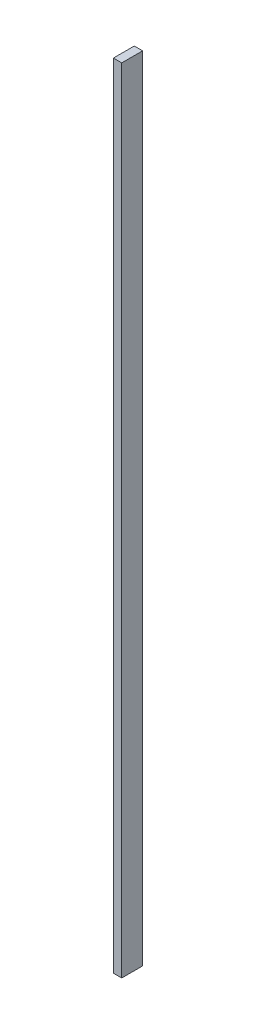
from build123d import *

# Parameters (mm, degrees)
ESQUISSE1_W      = 20
ESQUISSE1_H      = 50
EXTRUSION1_DEPTH = 1900


with BuildPart() as part:
    # Esquisse1 → Extrusion1 (new body)
    with BuildSketch(Plane(origin=(0, 0, 0), x_dir=(1, 0, 0), z_dir=(0, 1, 0))):
        with Locations((10, 25)):
            Rectangle(ESQUISSE1_W, ESQUISSE1_H)
    extrude(amount=EXTRUSION1_DEPTH)


solid = part.part
